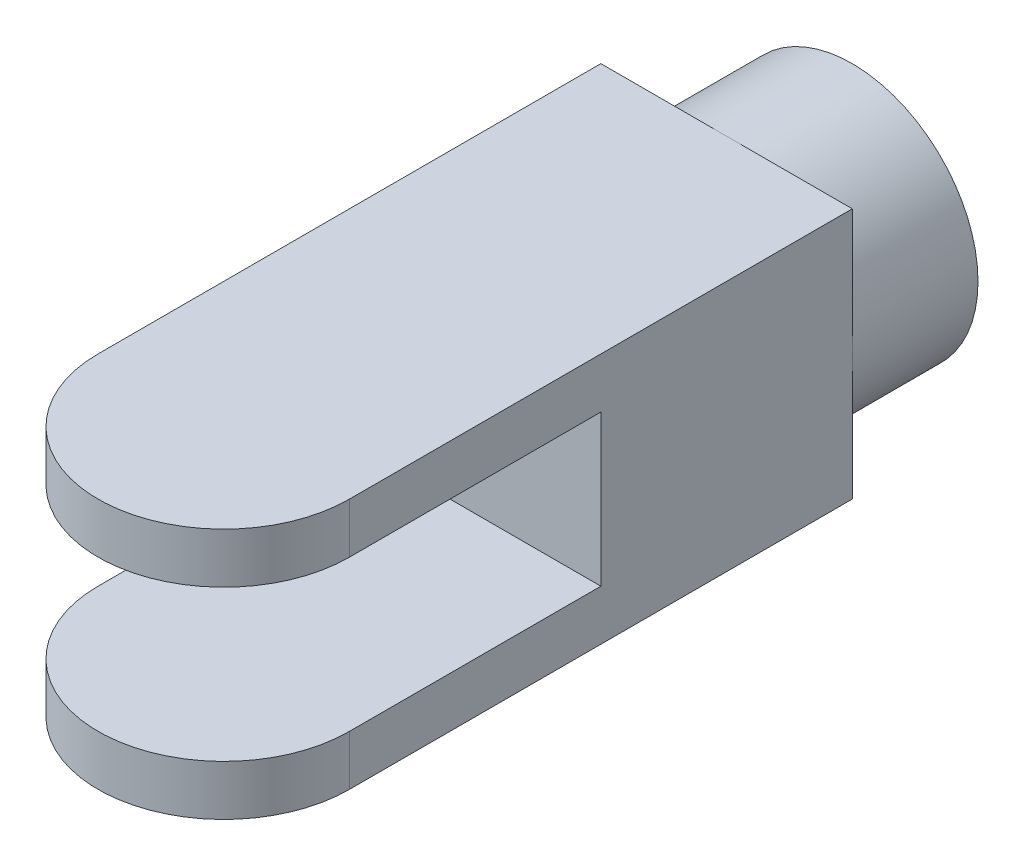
from build123d import *

# Parameters (mm, degrees)
ESQUISSE1_R             = 50
BOSS_EXTRU_1_DEPTH      = 50
BOSS_EXTRU_2_DEPTH      = 50
BOSS_EXTRU_2_DEPTH_BACK = 50
ESQUISSE3_W             = 150
ESQUISSE3_H             = 60
ENL_V_MAT_EXTRU_1_DEPTH = 321.156211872


with BuildPart() as part:
    # Esquisse1 → Boss.-Extru.1 (new body)
    with BuildSketch(Plane.XY):
        Circle(ESQUISSE1_R)
    extrude(amount=BOSS_EXTRU_1_DEPTH)

    # Esquisse2 → Boss.-Extru.2 (add, two sides: drawn at the far end of the back side and taken through both)
    with BuildSketch(Plane(origin=(0, 0, 0), x_dir=(1, 0, 0), z_dir=(0, 1, 0)).offset(-BOSS_EXTRU_2_DEPTH_BACK)):
        with BuildLine():
            Line((-50, -50), (-50, -250))
            ThreePointArc((-50, -250), (0, -300), (50, -250))
            Line((50, -250), (50, -50))
            Line((50, -50), (-50, -50))
        make_face()
    extrude(amount=BOSS_EXTRU_2_DEPTH + BOSS_EXTRU_2_DEPTH_BACK)

    # Esquisse3 → Enl_v. mat.-Extru.1 (cut, through all)
    with BuildSketch(Plane(origin=(50, 0, 0), x_dir=(0, 0, -1), z_dir=(1, 0, 0))):
        with Locations((-225, 0)):
            Rectangle(ESQUISSE3_W, ESQUISSE3_H)
    extrude(amount=-ENL_V_MAT_EXTRU_1_DEPTH, mode=Mode.SUBTRACT)


solid = part.part
